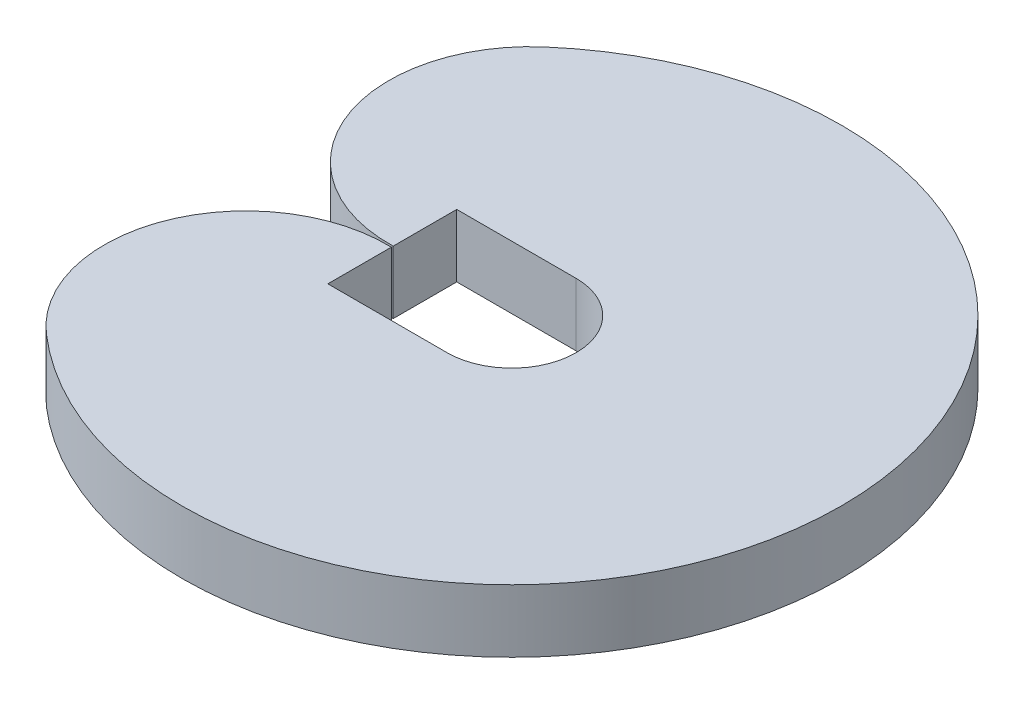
ISO-10303-21;
HEADER;
FILE_DESCRIPTION(('STEP AP214'),'2;1');
FILE_NAME('part.step','',(''),(''),'','','');
FILE_SCHEMA(('AUTOMOTIVE_DESIGN { 1 0 10303 214 1 1 1 1 }'));
ENDSEC;
DATA;
#1=APPLICATION_CONTEXT('core data for automotive mechanical design processes');
#2=APPLICATION_PROTOCOL_DEFINITION('international standard','automotive_design',2000,#1);
#3=PRODUCT_CONTEXT('',#1,'mechanical');
#4=PRODUCT('Part','Part','',(#3));
#5=PRODUCT_RELATED_PRODUCT_CATEGORY('part','',(#4));
#6=PRODUCT_DEFINITION_FORMATION('','',#4);
#7=PRODUCT_DEFINITION_CONTEXT('part definition',#1,'design');
#8=PRODUCT_DEFINITION('design','',#6,#7);
#9=PRODUCT_DEFINITION_SHAPE('','',#8);
#10=(LENGTH_UNIT() NAMED_UNIT(*) SI_UNIT(.MILLI.,.METRE.));
#11=(NAMED_UNIT(*) PLANE_ANGLE_UNIT() SI_UNIT($,.RADIAN.));
#12=(NAMED_UNIT(*) SI_UNIT($,.STERADIAN.) SOLID_ANGLE_UNIT());
#13=UNCERTAINTY_MEASURE_WITH_UNIT(LENGTH_MEASURE(1.E-05),#10,'distance_accuracy_value','');
#14=(GEOMETRIC_REPRESENTATION_CONTEXT(3) GLOBAL_UNCERTAINTY_ASSIGNED_CONTEXT((#13)) GLOBAL_UNIT_ASSIGNED_CONTEXT((#10,
#11,#12)) REPRESENTATION_CONTEXT('',''));
#15=CARTESIAN_POINT('',(0.,0.,0.));
#16=DIRECTION('',(0.,0.,1.));
#17=DIRECTION('',(1.,0.,0.));
#18=AXIS2_PLACEMENT_3D('',#15,#16,#17);
#19=CARTESIAN_POINT('',(-144.819615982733,108.42841252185,205.212085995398));
#20=DIRECTION('',(0.,0.,1.));
#21=DIRECTION('',(1.,0.,0.));
#22=AXIS2_PLACEMENT_3D('',#19,#20,#21);
#23=PLANE('',#22);
#24=DIRECTION('',(-1.,0.,0.));
#25=VECTOR('',#24,1.);
#26=CARTESIAN_POINT('',(-144.819615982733,-91.5715874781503,205.212085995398));
#27=LINE('',#26,#25);
#28=CARTESIAN_POINT('',(-144.819615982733,-91.5715874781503,205.212085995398));
#29=VERTEX_POINT('',#28);
#30=CARTESIAN_POINT('',(-524.819615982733,-91.5715874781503,205.212085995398));
#31=VERTEX_POINT('',#30);
#32=EDGE_CURVE('E112',#29,#31,#27,.T.);
#33=ORIENTED_EDGE('',*,*,#32,.T.);
#34=DIRECTION('',(0.,-1.,0.));
#35=VECTOR('',#34,1.);
#36=CARTESIAN_POINT('',(-524.819615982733,108.42841252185,205.212085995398));
#37=LINE('',#36,#35);
#38=CARTESIAN_POINT('',(-524.819615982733,108.42841252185,205.212085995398));
#39=VERTEX_POINT('',#38);
#40=EDGE_CURVE('E10',#39,#31,#37,.T.);
#41=ORIENTED_EDGE('',*,*,#40,.F.);
#42=DIRECTION('',(-1.,0.,0.));
#43=VECTOR('',#42,1.);
#44=CARTESIAN_POINT('',(-144.819615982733,108.42841252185,205.212085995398));
#45=LINE('',#44,#43);
#46=CARTESIAN_POINT('',(-144.819615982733,108.42841252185,205.212085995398));
#47=VERTEX_POINT('',#46);
#48=EDGE_CURVE('E69',#47,#39,#45,.T.);
#49=ORIENTED_EDGE('',*,*,#48,.F.);
#50=DIRECTION('',(0.,-1.,0.));
#51=VECTOR('',#50,1.);
#52=CARTESIAN_POINT('',(-144.819615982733,108.42841252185,205.212085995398));
#53=LINE('',#52,#51);
#54=EDGE_CURVE('E32',#47,#29,#53,.T.);
#55=ORIENTED_EDGE('',*,*,#54,.T.);
#56=EDGE_LOOP('',(#33,#41,#49,#55));
#57=FACE_BOUND('',#56,.T.);
#58=ADVANCED_FACE('F16',(#57),#23,.F.);
#59=CARTESIAN_POINT('',(-524.819615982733,108.42841252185,0.));
#60=DIRECTION('',(1.,0.,0.));
#61=DIRECTION('',(0.,0.,-1.));
#62=AXIS2_PLACEMENT_3D('',#59,#60,#61);
#63=PLANE('',#62);
#64=DIRECTION('',(0.,0.,1.));
#65=VECTOR('',#64,1.);
#66=CARTESIAN_POINT('',(-524.819615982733,-91.5715874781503,0.));
#67=LINE('',#66,#65);
#68=CARTESIAN_POINT('',(-524.819615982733,-91.5715874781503,3.03237847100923));
#69=VERTEX_POINT('',#68);
#70=EDGE_CURVE('E114',#69,#31,#67,.T.);
#71=ORIENTED_EDGE('',*,*,#70,.F.);
#72=DIRECTION('',(0.,-1.,0.));
#73=VECTOR('',#72,1.);
#74=CARTESIAN_POINT('',(-524.819615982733,108.42841252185,3.03237847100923));
#75=LINE('',#74,#73);
#76=CARTESIAN_POINT('',(-524.819615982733,108.42841252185,3.03237847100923));
#77=VERTEX_POINT('',#76);
#78=EDGE_CURVE('E24',#77,#69,#75,.T.);
#79=ORIENTED_EDGE('',*,*,#78,.F.);
#80=DIRECTION('',(0.,0.,1.));
#81=VECTOR('',#80,1.);
#82=CARTESIAN_POINT('',(-524.819615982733,108.42841252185,0.));
#83=LINE('',#82,#81);
#84=EDGE_CURVE('E104',#77,#39,#83,.T.);
#85=ORIENTED_EDGE('',*,*,#84,.T.);
#86=ORIENTED_EDGE('',*,*,#40,.T.);
#87=EDGE_LOOP('',(#71,#79,#85,#86));
#88=FACE_BOUND('',#87,.T.);
#89=ADVANCED_FACE('F150',(#88),#63,.T.);
#90=CARTESIAN_POINT('',(-538.45503337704,108.42841252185,452.825748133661));
#91=DIRECTION('',(0.,-1.,0.));
#92=DIRECTION('',(0.,0.,-1.));
#93=AXIS2_PLACEMENT_3D('',#90,#91,#92);
#94=CYLINDRICAL_SURFACE('',#93,450.);
#95=CARTESIAN_POINT('',(-538.45503337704,-91.5715874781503,452.825748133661));
#96=DIRECTION('',(0.,1.,0.));
#97=DIRECTION('',(0.,0.,1.));
#98=AXIS2_PLACEMENT_3D('',#95,#96,#97);
#99=CIRCLE('',#98,450.);
#100=CARTESIAN_POINT('',(-833.68159642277,-91.5715874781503,792.445059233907));
#101=VERTEX_POINT('',#100);
#102=EDGE_CURVE('E117',#69,#101,#99,.T.);
#103=ORIENTED_EDGE('',*,*,#102,.T.);
#104=DIRECTION('',(0.,-1.,0.));
#105=VECTOR('',#104,1.);
#106=CARTESIAN_POINT('',(-833.68159642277,108.42841252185,792.445059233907));
#107=LINE('',#106,#105);
#108=CARTESIAN_POINT('',(-833.68159642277,108.42841252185,792.445059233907));
#109=VERTEX_POINT('',#108);
#110=EDGE_CURVE('E135',#109,#101,#107,.T.);
#111=ORIENTED_EDGE('',*,*,#110,.F.);
#112=CARTESIAN_POINT('',(-538.45503337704,108.42841252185,452.825748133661));
#113=DIRECTION('',(0.,1.,0.));
#114=DIRECTION('',(0.,0.,1.));
#115=AXIS2_PLACEMENT_3D('',#112,#113,#114);
#116=CIRCLE('',#115,450.);
#117=EDGE_CURVE('E142',#77,#109,#116,.T.);
#118=ORIENTED_EDGE('',*,*,#117,.F.);
#119=ORIENTED_EDGE('',*,*,#78,.T.);
#120=EDGE_LOOP('',(#103,#111,#118,#119));
#121=FACE_BOUND('',#120,.T.);
#122=ADVANCED_FACE('F140',(#121),#94,.T.);
#123=CARTESIAN_POINT('',(-144.819615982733,108.42841252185,0.));
#124=DIRECTION('',(0.,-1.,0.));
#125=DIRECTION('',(0.,0.,-1.));
#126=AXIS2_PLACEMENT_3D('',#123,#124,#125);
#127=CYLINDRICAL_SURFACE('',#126,1050.);
#128=CARTESIAN_POINT('',(-144.819615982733,-91.5715874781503,0.));
#129=DIRECTION('',(0.,1.,0.));
#130=DIRECTION('',(0.,0.,1.));
#131=AXIS2_PLACEMENT_3D('',#128,#129,#130);
#132=CIRCLE('',#131,1050.);
#133=CARTESIAN_POINT('',(-833.68159642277,-91.5715874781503,-792.445059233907));
#134=VERTEX_POINT('',#133);
#135=EDGE_CURVE('E119',#101,#134,#132,.T.);
#136=ORIENTED_EDGE('',*,*,#135,.T.);
#137=DIRECTION('',(0.,-1.,0.));
#138=VECTOR('',#137,1.);
#139=CARTESIAN_POINT('',(-833.68159642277,108.42841252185,-792.445059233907));
#140=LINE('',#139,#138);
#141=CARTESIAN_POINT('',(-833.68159642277,108.42841252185,-792.445059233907));
#142=VERTEX_POINT('',#141);
#143=EDGE_CURVE('E132',#142,#134,#140,.T.);
#144=ORIENTED_EDGE('',*,*,#143,.F.);
#145=CARTESIAN_POINT('',(-144.819615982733,108.42841252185,0.));
#146=DIRECTION('',(0.,1.,0.));
#147=DIRECTION('',(0.,0.,1.));
#148=AXIS2_PLACEMENT_3D('',#145,#146,#147);
#149=CIRCLE('',#148,1050.);
#150=EDGE_CURVE('E185',#109,#142,#149,.T.);
#151=ORIENTED_EDGE('',*,*,#150,.F.);
#152=ORIENTED_EDGE('',*,*,#110,.T.);
#153=EDGE_LOOP('',(#136,#144,#151,#152));
#154=FACE_BOUND('',#153,.T.);
#155=ADVANCED_FACE('F170',(#154),#127,.T.);
#156=CARTESIAN_POINT('',(-538.45503337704,108.42841252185,-452.825748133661));
#157=DIRECTION('',(0.,-1.,0.));
#158=DIRECTION('',(0.,0.,-1.));
#159=AXIS2_PLACEMENT_3D('',#156,#157,#158);
#160=CYLINDRICAL_SURFACE('',#159,450.);
#161=CARTESIAN_POINT('',(-538.45503337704,-91.5715874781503,-452.825748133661));
#162=DIRECTION('',(0.,1.,0.));
#163=DIRECTION('',(0.,0.,1.));
#164=AXIS2_PLACEMENT_3D('',#161,#162,#163);
#165=CIRCLE('',#164,450.);
#166=CARTESIAN_POINT('',(-524.819615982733,-91.5715874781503,-3.03237847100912));
#167=VERTEX_POINT('',#166);
#168=EDGE_CURVE('E121',#134,#167,#165,.T.);
#169=ORIENTED_EDGE('',*,*,#168,.T.);
#170=DIRECTION('',(0.,-1.,0.));
#171=VECTOR('',#170,1.);
#172=CARTESIAN_POINT('',(-524.819615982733,108.42841252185,-3.03237847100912));
#173=LINE('',#172,#171);
#174=CARTESIAN_POINT('',(-524.819615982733,108.42841252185,-3.03237847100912));
#175=VERTEX_POINT('',#174);
#176=EDGE_CURVE('E95',#175,#167,#173,.T.);
#177=ORIENTED_EDGE('',*,*,#176,.F.);
#178=CARTESIAN_POINT('',(-538.45503337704,108.42841252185,-452.825748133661));
#179=DIRECTION('',(0.,1.,0.));
#180=DIRECTION('',(0.,0.,1.));
#181=AXIS2_PLACEMENT_3D('',#178,#179,#180);
#182=CIRCLE('',#181,450.);
#183=EDGE_CURVE('E101',#142,#175,#182,.T.);
#184=ORIENTED_EDGE('',*,*,#183,.F.);
#185=ORIENTED_EDGE('',*,*,#143,.T.);
#186=EDGE_LOOP('',(#169,#177,#184,#185));
#187=FACE_BOUND('',#186,.T.);
#188=ADVANCED_FACE('F173',(#187),#160,.T.);
#189=CARTESIAN_POINT('',(-524.819615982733,-91.5715874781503,-205.212085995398));
#190=VERTEX_POINT('',#189);
#191=EDGE_CURVE('E91',#190,#167,#67,.T.);
#192=ORIENTED_EDGE('',*,*,#191,.F.);
#193=DIRECTION('',(0.,-1.,0.));
#194=VECTOR('',#193,1.);
#195=CARTESIAN_POINT('',(-524.819615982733,108.42841252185,-205.212085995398));
#196=LINE('',#195,#194);
#197=CARTESIAN_POINT('',(-524.819615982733,108.42841252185,-205.212085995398));
#198=VERTEX_POINT('',#197);
#199=EDGE_CURVE('E86',#198,#190,#196,.T.);
#200=ORIENTED_EDGE('',*,*,#199,.F.);
#201=EDGE_CURVE('E89',#198,#175,#83,.T.);
#202=ORIENTED_EDGE('',*,*,#201,.T.);
#203=ORIENTED_EDGE('',*,*,#176,.T.);
#204=EDGE_LOOP('',(#192,#200,#202,#203));
#205=FACE_BOUND('',#204,.T.);
#206=ADVANCED_FACE('F88',(#205),#63,.T.);
#207=CARTESIAN_POINT('',(-144.819615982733,108.42841252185,-205.212085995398));
#208=DIRECTION('',(0.,0.,1.));
#209=DIRECTION('',(1.,0.,0.));
#210=AXIS2_PLACEMENT_3D('',#207,#208,#209);
#211=PLANE('',#210);
#212=DIRECTION('',(-1.,0.,0.));
#213=VECTOR('',#212,1.);
#214=CARTESIAN_POINT('',(-144.819615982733,-91.5715874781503,-205.212085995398));
#215=LINE('',#214,#213);
#216=CARTESIAN_POINT('',(-144.819615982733,-91.5715874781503,-205.212085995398));
#217=VERTEX_POINT('',#216);
#218=EDGE_CURVE('E124',#217,#190,#215,.T.);
#219=ORIENTED_EDGE('',*,*,#218,.F.);
#220=DIRECTION('',(0.,-1.,0.));
#221=VECTOR('',#220,1.);
#222=CARTESIAN_POINT('',(-144.819615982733,108.42841252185,-205.212085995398));
#223=LINE('',#222,#221);
#224=CARTESIAN_POINT('',(-144.819615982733,108.42841252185,-205.212085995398));
#225=VERTEX_POINT('',#224);
#226=EDGE_CURVE('E57',#225,#217,#223,.T.);
#227=ORIENTED_EDGE('',*,*,#226,.F.);
#228=DIRECTION('',(-1.,0.,0.));
#229=VECTOR('',#228,1.);
#230=CARTESIAN_POINT('',(-144.819615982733,108.42841252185,-205.212085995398));
#231=LINE('',#230,#229);
#232=EDGE_CURVE('E99',#225,#198,#231,.T.);
#233=ORIENTED_EDGE('',*,*,#232,.T.);
#234=ORIENTED_EDGE('',*,*,#199,.T.);
#235=EDGE_LOOP('',(#219,#227,#233,#234));
#236=FACE_BOUND('',#235,.T.);
#237=ADVANCED_FACE('F105',(#236),#211,.T.);
#238=CARTESIAN_POINT('',(-144.819615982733,108.42841252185,0.));
#239=DIRECTION('',(0.,-1.,0.));
#240=DIRECTION('',(0.,0.,-1.));
#241=AXIS2_PLACEMENT_3D('',#238,#239,#240);
#242=CYLINDRICAL_SURFACE('',#241,205.212085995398);
#243=CARTESIAN_POINT('',(-144.819615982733,-91.5715874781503,0.));
#244=DIRECTION('',(0.,1.,0.));
#245=DIRECTION('',(0.,0.,1.));
#246=AXIS2_PLACEMENT_3D('',#243,#244,#245);
#247=CIRCLE('',#246,205.212085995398);
#248=EDGE_CURVE('E126',#29,#217,#247,.T.);
#249=ORIENTED_EDGE('',*,*,#248,.F.);
#250=ORIENTED_EDGE('',*,*,#54,.F.);
#251=CARTESIAN_POINT('',(-144.819615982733,108.42841252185,0.));
#252=DIRECTION('',(0.,1.,0.));
#253=DIRECTION('',(0.,0.,1.));
#254=AXIS2_PLACEMENT_3D('',#251,#252,#253);
#255=CIRCLE('',#254,205.212085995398);
#256=EDGE_CURVE('E106',#47,#225,#255,.T.);
#257=ORIENTED_EDGE('',*,*,#256,.T.);
#258=ORIENTED_EDGE('',*,*,#226,.T.);
#259=EDGE_LOOP('',(#249,#250,#257,#258));
#260=FACE_BOUND('',#259,.T.);
#261=ADVANCED_FACE('F151',(#260),#242,.F.);
#262=CARTESIAN_POINT('',(-144.819615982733,108.42841252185,0.));
#263=DIRECTION('',(0.,1.,0.));
#264=DIRECTION('',(0.,0.,1.));
#265=AXIS2_PLACEMENT_3D('',#262,#263,#264);
#266=PLANE('',#265);
#267=ORIENTED_EDGE('',*,*,#48,.T.);
#268=ORIENTED_EDGE('',*,*,#84,.F.);
#269=ORIENTED_EDGE('',*,*,#117,.T.);
#270=ORIENTED_EDGE('',*,*,#150,.T.);
#271=ORIENTED_EDGE('',*,*,#183,.T.);
#272=ORIENTED_EDGE('',*,*,#201,.F.);
#273=ORIENTED_EDGE('',*,*,#232,.F.);
#274=ORIENTED_EDGE('',*,*,#256,.F.);
#275=EDGE_LOOP('',(#267,#268,#269,#270,#271,#272,#273,#274));
#276=FACE_BOUND('',#275,.T.);
#277=ADVANCED_FACE('F98',(#276),#266,.T.);
#278=CARTESIAN_POINT('',(-144.819615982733,-91.5715874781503,0.));
#279=DIRECTION('',(0.,1.,0.));
#280=DIRECTION('',(0.,0.,1.));
#281=AXIS2_PLACEMENT_3D('',#278,#279,#280);
#282=PLANE('',#281);
#283=ORIENTED_EDGE('',*,*,#32,.F.);
#284=ORIENTED_EDGE('',*,*,#248,.T.);
#285=ORIENTED_EDGE('',*,*,#218,.T.);
#286=ORIENTED_EDGE('',*,*,#191,.T.);
#287=ORIENTED_EDGE('',*,*,#168,.F.);
#288=ORIENTED_EDGE('',*,*,#135,.F.);
#289=ORIENTED_EDGE('',*,*,#102,.F.);
#290=ORIENTED_EDGE('',*,*,#70,.T.);
#291=EDGE_LOOP('',(#283,#284,#285,#286,#287,#288,#289,#290));
#292=FACE_BOUND('',#291,.T.);
#293=ADVANCED_FACE('F148',(#292),#282,.F.);
#294=CLOSED_SHELL('',(#58,#89,#122,#155,#188,#206,#237,#261,#277,#293));
#295=MANIFOLD_SOLID_BREP('B1',#294);
#296=ADVANCED_BREP_SHAPE_REPRESENTATION('',(#18,#295),#14);
#297=SHAPE_DEFINITION_REPRESENTATION(#9,#296);
ENDSEC;
END-ISO-10303-21;
